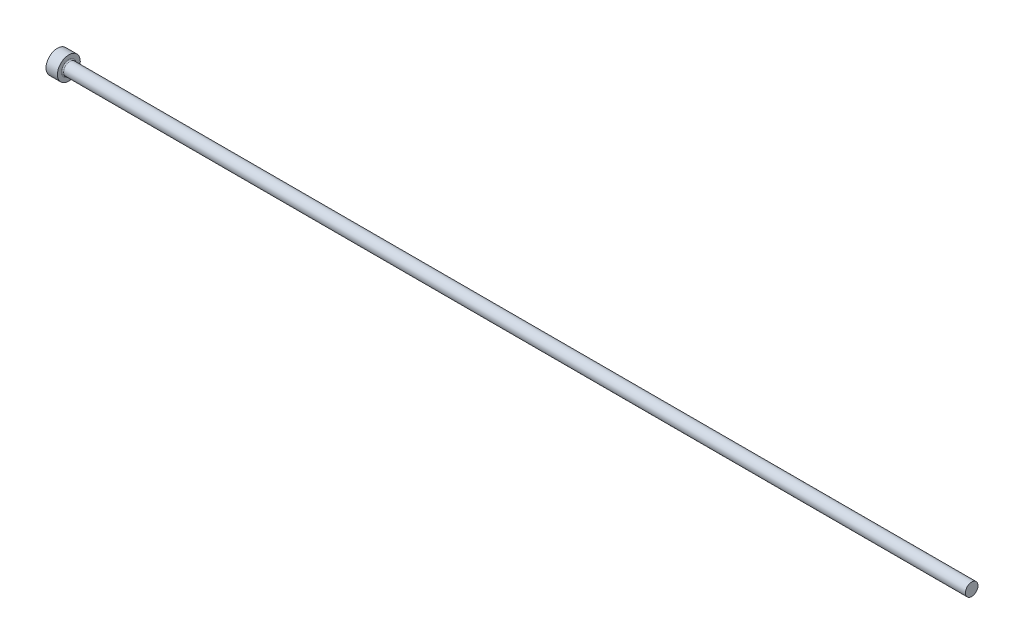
ISO-10303-21;
HEADER;
FILE_DESCRIPTION(('STEP AP214'),'2;1');
FILE_NAME('part.step','',(''),(''),'','','');
FILE_SCHEMA(('AUTOMOTIVE_DESIGN { 1 0 10303 214 1 1 1 1 }'));
ENDSEC;
DATA;
#1=APPLICATION_CONTEXT('core data for automotive mechanical design processes');
#2=APPLICATION_PROTOCOL_DEFINITION('international standard','automotive_design',2000,#1);
#3=PRODUCT_CONTEXT('',#1,'mechanical');
#4=PRODUCT('Part','Part','',(#3));
#5=PRODUCT_RELATED_PRODUCT_CATEGORY('part','',(#4));
#6=PRODUCT_DEFINITION_FORMATION('','',#4);
#7=PRODUCT_DEFINITION_CONTEXT('part definition',#1,'design');
#8=PRODUCT_DEFINITION('design','',#6,#7);
#9=PRODUCT_DEFINITION_SHAPE('','',#8);
#10=(LENGTH_UNIT() NAMED_UNIT(*) SI_UNIT(.MILLI.,.METRE.));
#11=(NAMED_UNIT(*) PLANE_ANGLE_UNIT() SI_UNIT($,.RADIAN.));
#12=(NAMED_UNIT(*) SI_UNIT($,.STERADIAN.) SOLID_ANGLE_UNIT());
#13=UNCERTAINTY_MEASURE_WITH_UNIT(LENGTH_MEASURE(1.E-05),#10,'distance_accuracy_value','');
#14=(GEOMETRIC_REPRESENTATION_CONTEXT(3) GLOBAL_UNCERTAINTY_ASSIGNED_CONTEXT((#13)) GLOBAL_UNIT_ASSIGNED_CONTEXT((#10,
#11,#12)) REPRESENTATION_CONTEXT('',''));
#15=CARTESIAN_POINT('',(0.,0.,0.));
#16=DIRECTION('',(0.,0.,1.));
#17=DIRECTION('',(1.,0.,0.));
#18=AXIS2_PLACEMENT_3D('',#15,#16,#17);
#19=CARTESIAN_POINT('',(0.,0.,0.));
#20=DIRECTION('',(-1.,0.,0.));
#21=DIRECTION('',(0.,-1.,0.));
#22=AXIS2_PLACEMENT_3D('',#19,#20,#21);
#23=PLANE('',#22);
#24=CARTESIAN_POINT('',(0.,0.,0.));
#25=DIRECTION('',(1.,0.,0.));
#26=DIRECTION('',(0.,1.,0.));
#27=AXIS2_PLACEMENT_3D('',#24,#25,#26);
#28=CIRCLE('',#27,2.);
#29=CARTESIAN_POINT('',(0.,2.,0.));
#30=VERTEX_POINT('',#29);
#31=EDGE_CURVE('E25',#30,#30,#28,.T.);
#32=ORIENTED_EDGE('',*,*,#31,.F.);
#33=EDGE_LOOP('',(#32));
#34=FACE_BOUND('',#33,.T.);
#35=ADVANCED_FACE('F14',(#34),#23,.T.);
#36=CARTESIAN_POINT('',(160.,0.,0.));
#37=DIRECTION('',(1.,0.,0.));
#38=DIRECTION('',(0.,1.,0.));
#39=AXIS2_PLACEMENT_3D('',#36,#37,#38);
#40=CYLINDRICAL_SURFACE('',#39,2.);
#41=ORIENTED_EDGE('',*,*,#31,.T.);
#42=EDGE_LOOP('',(#41));
#43=FACE_BOUND('',#42,.T.);
#44=CARTESIAN_POINT('',(2.,0.,0.));
#45=DIRECTION('',(1.,0.,0.));
#46=DIRECTION('',(0.,1.,0.));
#47=AXIS2_PLACEMENT_3D('',#44,#45,#46);
#48=CIRCLE('',#47,2.);
#49=CARTESIAN_POINT('',(2.,2.,0.));
#50=VERTEX_POINT('',#49);
#51=EDGE_CURVE('E29',#50,#50,#48,.T.);
#52=ORIENTED_EDGE('',*,*,#51,.F.);
#53=EDGE_LOOP('',(#52));
#54=FACE_BOUND('',#53,.T.);
#55=ADVANCED_FACE('F51',(#43,#54),#40,.T.);
#56=CARTESIAN_POINT('',(2.,2.,0.));
#57=DIRECTION('',(1.,0.,0.));
#58=DIRECTION('',(0.,1.,0.));
#59=AXIS2_PLACEMENT_3D('',#56,#57,#58);
#60=PLANE('',#59);
#61=CARTESIAN_POINT('',(2.,0.,0.));
#62=DIRECTION('',(1.,0.,0.));
#63=DIRECTION('',(0.,1.,0.));
#64=AXIS2_PLACEMENT_3D('',#61,#62,#63);
#65=CIRCLE('',#64,1.29999999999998);
#66=CARTESIAN_POINT('',(2.,1.29999999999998,0.));
#67=VERTEX_POINT('',#66);
#68=EDGE_CURVE('E9',#67,#67,#65,.F.);
#69=ORIENTED_EDGE('',*,*,#68,.T.);
#70=EDGE_LOOP('',(#69));
#71=FACE_BOUND('',#70,.T.);
#72=ORIENTED_EDGE('',*,*,#51,.T.);
#73=EDGE_LOOP('',(#72));
#74=FACE_BOUND('',#73,.T.);
#75=ADVANCED_FACE('F42',(#71,#74),#60,.T.);
#76=CARTESIAN_POINT('',(160.,0.,0.));
#77=DIRECTION('',(1.,0.,0.));
#78=DIRECTION('',(0.,1.,0.));
#79=AXIS2_PLACEMENT_3D('',#76,#77,#78);
#80=CYLINDRICAL_SURFACE('',#79,1.09999999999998);
#81=CARTESIAN_POINT('',(2.2,0.,0.));
#82=DIRECTION('',(1.,0.,0.));
#83=DIRECTION('',(0.,1.,0.));
#84=AXIS2_PLACEMENT_3D('',#81,#82,#83);
#85=CIRCLE('',#84,1.09999999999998);
#86=CARTESIAN_POINT('',(2.2,1.09999999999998,0.));
#87=VERTEX_POINT('',#86);
#88=EDGE_CURVE('E21',#87,#87,#85,.T.);
#89=ORIENTED_EDGE('',*,*,#88,.T.);
#90=EDGE_LOOP('',(#89));
#91=FACE_BOUND('',#90,.T.);
#92=CARTESIAN_POINT('',(160.,0.,0.));
#93=DIRECTION('',(1.,0.,0.));
#94=DIRECTION('',(0.,1.,0.));
#95=AXIS2_PLACEMENT_3D('',#92,#93,#94);
#96=CIRCLE('',#95,1.09999999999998);
#97=CARTESIAN_POINT('',(160.,1.09999999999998,0.));
#98=VERTEX_POINT('',#97);
#99=EDGE_CURVE('E34',#98,#98,#96,.T.);
#100=ORIENTED_EDGE('',*,*,#99,.F.);
#101=EDGE_LOOP('',(#100));
#102=FACE_BOUND('',#101,.T.);
#103=ADVANCED_FACE('F40',(#91,#102),#80,.T.);
#104=CARTESIAN_POINT('',(160.,1.09999999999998,0.));
#105=DIRECTION('',(1.,0.,0.));
#106=DIRECTION('',(0.,1.,0.));
#107=AXIS2_PLACEMENT_3D('',#104,#105,#106);
#108=PLANE('',#107);
#109=ORIENTED_EDGE('',*,*,#99,.T.);
#110=EDGE_LOOP('',(#109));
#111=FACE_BOUND('',#110,.T.);
#112=ADVANCED_FACE('F38',(#111),#108,.T.);
#113=CARTESIAN_POINT('',(2.2,0.,0.));
#114=DIRECTION('',(1.,0.,0.));
#115=DIRECTION('',(0.,1.,0.));
#116=AXIS2_PLACEMENT_3D('',#113,#114,#115);
#117=TOROIDAL_SURFACE('',#116,1.29999999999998,0.2);
#118=ORIENTED_EDGE('',*,*,#68,.F.);
#119=EDGE_LOOP('',(#118));
#120=FACE_BOUND('',#119,.T.);
#121=ORIENTED_EDGE('',*,*,#88,.F.);
#122=EDGE_LOOP('',(#121));
#123=FACE_BOUND('',#122,.T.);
#124=ADVANCED_FACE('F16',(#120,#123),#117,.F.);
#125=CLOSED_SHELL('',(#35,#55,#75,#103,#112,#124));
#126=MANIFOLD_SOLID_BREP('B1',#125);
#127=ADVANCED_BREP_SHAPE_REPRESENTATION('',(#18,#126),#14);
#128=SHAPE_DEFINITION_REPRESENTATION(#9,#127);
ENDSEC;
END-ISO-10303-21;
